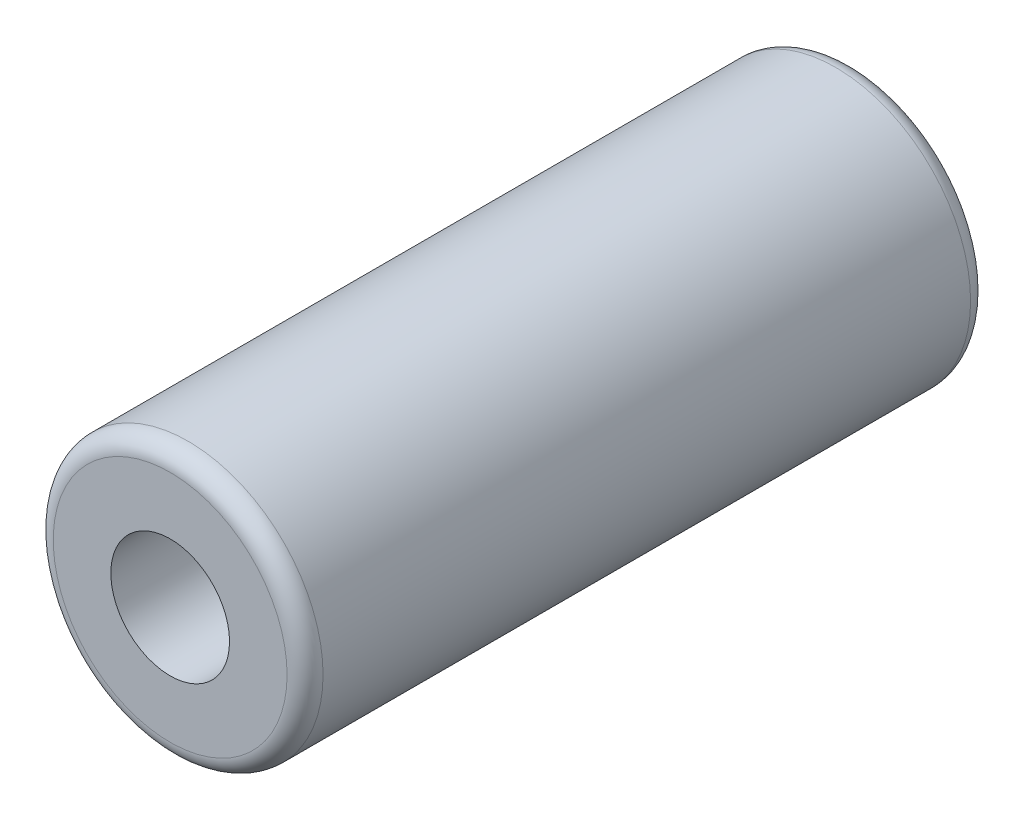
ISO-10303-21;
HEADER;
FILE_DESCRIPTION(('STEP AP214'),'2;1');
FILE_NAME('part.step','',(''),(''),'','','');
FILE_SCHEMA(('AUTOMOTIVE_DESIGN { 1 0 10303 214 1 1 1 1 }'));
ENDSEC;
DATA;
#1=APPLICATION_CONTEXT('core data for automotive mechanical design processes');
#2=APPLICATION_PROTOCOL_DEFINITION('international standard','automotive_design',2000,#1);
#3=PRODUCT_CONTEXT('',#1,'mechanical');
#4=PRODUCT('Part','Part','',(#3));
#5=PRODUCT_RELATED_PRODUCT_CATEGORY('part','',(#4));
#6=PRODUCT_DEFINITION_FORMATION('','',#4);
#7=PRODUCT_DEFINITION_CONTEXT('part definition',#1,'design');
#8=PRODUCT_DEFINITION('design','',#6,#7);
#9=PRODUCT_DEFINITION_SHAPE('','',#8);
#10=(LENGTH_UNIT() NAMED_UNIT(*) SI_UNIT(.MILLI.,.METRE.));
#11=(NAMED_UNIT(*) PLANE_ANGLE_UNIT() SI_UNIT($,.RADIAN.));
#12=(NAMED_UNIT(*) SI_UNIT($,.STERADIAN.) SOLID_ANGLE_UNIT());
#13=UNCERTAINTY_MEASURE_WITH_UNIT(LENGTH_MEASURE(1.E-05),#10,'distance_accuracy_value','');
#14=(GEOMETRIC_REPRESENTATION_CONTEXT(3) GLOBAL_UNCERTAINTY_ASSIGNED_CONTEXT((#13)) GLOBAL_UNIT_ASSIGNED_CONTEXT((#10,
#11,#12)) REPRESENTATION_CONTEXT('',''));
#15=CARTESIAN_POINT('',(0.,0.,0.));
#16=DIRECTION('',(0.,0.,1.));
#17=DIRECTION('',(1.,0.,0.));
#18=AXIS2_PLACEMENT_3D('',#15,#16,#17);
#19=CARTESIAN_POINT('',(0.,0.,190.));
#20=DIRECTION('',(0.,0.,-1.));
#21=DIRECTION('',(-1.,0.,0.));
#22=AXIS2_PLACEMENT_3D('',#19,#20,#21);
#23=CYLINDRICAL_SURFACE('',#22,37.5);
#24=CARTESIAN_POINT('',(0.,0.,5.));
#25=DIRECTION('',(0.,0.,1.));
#26=DIRECTION('',(1.,0.,0.));
#27=AXIS2_PLACEMENT_3D('',#24,#25,#26);
#28=CIRCLE('',#27,37.5);
#29=CARTESIAN_POINT('',(37.5,0.,5.));
#30=VERTEX_POINT('',#29);
#31=EDGE_CURVE('E41',#30,#30,#28,.T.);
#32=ORIENTED_EDGE('',*,*,#31,.T.);
#33=EDGE_LOOP('',(#32));
#34=FACE_BOUND('',#33,.T.);
#35=CARTESIAN_POINT('',(0.,0.,185.));
#36=DIRECTION('',(0.,0.,1.));
#37=DIRECTION('',(1.,0.,0.));
#38=AXIS2_PLACEMENT_3D('',#35,#36,#37);
#39=CIRCLE('',#38,37.5);
#40=CARTESIAN_POINT('',(37.5,0.,185.));
#41=VERTEX_POINT('',#40);
#42=EDGE_CURVE('E45',#41,#41,#39,.F.);
#43=ORIENTED_EDGE('',*,*,#42,.T.);
#44=EDGE_LOOP('',(#43));
#45=FACE_BOUND('',#44,.T.);
#46=ADVANCED_FACE('F30',(#34,#45),#23,.T.);
#47=CARTESIAN_POINT('',(0.,0.,190.));
#48=DIRECTION('',(0.,0.,1.));
#49=DIRECTION('',(1.,0.,0.));
#50=AXIS2_PLACEMENT_3D('',#47,#48,#49);
#51=PLANE('',#50);
#52=CARTESIAN_POINT('',(0.,0.,190.));
#53=DIRECTION('',(0.,0.,1.));
#54=DIRECTION('',(1.,0.,0.));
#55=AXIS2_PLACEMENT_3D('',#52,#53,#54);
#56=CIRCLE('',#55,32.5);
#57=CARTESIAN_POINT('',(32.5,0.,190.));
#58=VERTEX_POINT('',#57);
#59=EDGE_CURVE('E10',#58,#58,#56,.T.);
#60=ORIENTED_EDGE('',*,*,#59,.T.);
#61=EDGE_LOOP('',(#60));
#62=FACE_BOUND('',#61,.T.);
#63=CARTESIAN_POINT('',(0.,0.,190.));
#64=DIRECTION('',(0.,0.,1.));
#65=DIRECTION('',(1.,0.,0.));
#66=AXIS2_PLACEMENT_3D('',#63,#64,#65);
#67=CIRCLE('',#66,16.5);
#68=CARTESIAN_POINT('',(16.5,0.,190.));
#69=VERTEX_POINT('',#68);
#70=EDGE_CURVE('E53',#69,#69,#67,.T.);
#71=ORIENTED_EDGE('',*,*,#70,.F.);
#72=EDGE_LOOP('',(#71));
#73=FACE_BOUND('',#72,.T.);
#74=ADVANCED_FACE('F60',(#62,#73),#51,.T.);
#75=CARTESIAN_POINT('',(0.,0.,0.));
#76=DIRECTION('',(0.,0.,1.));
#77=DIRECTION('',(1.,0.,0.));
#78=AXIS2_PLACEMENT_3D('',#75,#76,#77);
#79=PLANE('',#78);
#80=CARTESIAN_POINT('',(0.,0.,0.));
#81=DIRECTION('',(0.,0.,1.));
#82=DIRECTION('',(1.,0.,0.));
#83=AXIS2_PLACEMENT_3D('',#80,#81,#82);
#84=CIRCLE('',#83,32.5);
#85=CARTESIAN_POINT('',(32.5,0.,0.));
#86=VERTEX_POINT('',#85);
#87=EDGE_CURVE('E37',#86,#86,#84,.F.);
#88=ORIENTED_EDGE('',*,*,#87,.T.);
#89=EDGE_LOOP('',(#88));
#90=FACE_BOUND('',#89,.T.);
#91=CARTESIAN_POINT('',(0.,0.,0.));
#92=DIRECTION('',(0.,0.,1.));
#93=DIRECTION('',(1.,0.,0.));
#94=AXIS2_PLACEMENT_3D('',#91,#92,#93);
#95=CIRCLE('',#94,16.5);
#96=CARTESIAN_POINT('',(16.5,0.,0.));
#97=VERTEX_POINT('',#96);
#98=EDGE_CURVE('E50',#97,#97,#95,.F.);
#99=ORIENTED_EDGE('',*,*,#98,.F.);
#100=EDGE_LOOP('',(#99));
#101=FACE_BOUND('',#100,.T.);
#102=ADVANCED_FACE('F62',(#90,#101),#79,.F.);
#103=CARTESIAN_POINT('',(0.,0.,-0.001000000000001));
#104=DIRECTION('',(0.,0.,1.));
#105=DIRECTION('',(1.,0.,0.));
#106=AXIS2_PLACEMENT_3D('',#103,#104,#105);
#107=CYLINDRICAL_SURFACE('',#106,16.5);
#108=CARTESIAN_POINT('',(16.5,0.,190.));
#109=CARTESIAN_POINT('',(16.5,0.,188.020833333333));
#110=CARTESIAN_POINT('',(16.5,0.,186.041666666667));
#111=CARTESIAN_POINT('',(16.5,0.,182.083333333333));
#112=CARTESIAN_POINT('',(16.5,0.,180.104166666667));
#113=CARTESIAN_POINT('',(16.5,0.,176.145833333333));
#114=CARTESIAN_POINT('',(16.5,0.,174.166666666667));
#115=CARTESIAN_POINT('',(16.5,0.,170.208333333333));
#116=CARTESIAN_POINT('',(16.5,0.,168.229166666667));
#117=CARTESIAN_POINT('',(16.5,0.,164.270833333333));
#118=CARTESIAN_POINT('',(16.5,0.,162.291666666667));
#119=CARTESIAN_POINT('',(16.5,0.,158.333333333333));
#120=CARTESIAN_POINT('',(16.5,0.,156.354166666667));
#121=CARTESIAN_POINT('',(16.5,0.,152.395833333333));
#122=CARTESIAN_POINT('',(16.5,0.,150.416666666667));
#123=CARTESIAN_POINT('',(16.5,0.,146.458333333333));
#124=CARTESIAN_POINT('',(16.5,0.,144.479166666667));
#125=CARTESIAN_POINT('',(16.5,0.,140.520833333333));
#126=CARTESIAN_POINT('',(16.5,0.,138.541666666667));
#127=CARTESIAN_POINT('',(16.5,0.,134.583333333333));
#128=CARTESIAN_POINT('',(16.5,0.,132.604166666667));
#129=CARTESIAN_POINT('',(16.5,0.,128.645833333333));
#130=CARTESIAN_POINT('',(16.5,0.,126.666666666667));
#131=CARTESIAN_POINT('',(16.5,0.,122.708333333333));
#132=CARTESIAN_POINT('',(16.5,0.,120.729166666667));
#133=CARTESIAN_POINT('',(16.5,0.,116.770833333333));
#134=CARTESIAN_POINT('',(16.5,0.,114.791666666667));
#135=CARTESIAN_POINT('',(16.5,0.,110.833333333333));
#136=CARTESIAN_POINT('',(16.5,0.,108.854166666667));
#137=CARTESIAN_POINT('',(16.5,0.,104.895833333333));
#138=CARTESIAN_POINT('',(16.5,0.,102.916666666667));
#139=CARTESIAN_POINT('',(16.5,0.,98.9583333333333));
#140=CARTESIAN_POINT('',(16.5,0.,96.9791666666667));
#141=CARTESIAN_POINT('',(16.5,0.,93.0208333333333));
#142=CARTESIAN_POINT('',(16.5,0.,91.0416666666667));
#143=CARTESIAN_POINT('',(16.5,0.,87.0833333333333));
#144=CARTESIAN_POINT('',(16.5,0.,85.1041666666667));
#145=CARTESIAN_POINT('',(16.5,0.,81.1458333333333));
#146=CARTESIAN_POINT('',(16.5,0.,79.1666666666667));
#147=CARTESIAN_POINT('',(16.5,0.,75.2083333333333));
#148=CARTESIAN_POINT('',(16.5,0.,73.2291666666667));
#149=CARTESIAN_POINT('',(16.5,0.,69.2708333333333));
#150=CARTESIAN_POINT('',(16.5,0.,67.2916666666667));
#151=CARTESIAN_POINT('',(16.5,0.,63.3333333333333));
#152=CARTESIAN_POINT('',(16.5,0.,61.3541666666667));
#153=CARTESIAN_POINT('',(16.5,0.,57.3958333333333));
#154=CARTESIAN_POINT('',(16.5,0.,55.4166666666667));
#155=CARTESIAN_POINT('',(16.5,0.,51.4583333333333));
#156=CARTESIAN_POINT('',(16.5,0.,49.4791666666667));
#157=CARTESIAN_POINT('',(16.5,0.,45.5208333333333));
#158=CARTESIAN_POINT('',(16.5,0.,43.5416666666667));
#159=CARTESIAN_POINT('',(16.5,0.,39.5833333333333));
#160=CARTESIAN_POINT('',(16.5,0.,37.6041666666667));
#161=CARTESIAN_POINT('',(16.5,0.,33.6458333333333));
#162=CARTESIAN_POINT('',(16.5,0.,31.6666666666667));
#163=CARTESIAN_POINT('',(16.5,0.,27.7083333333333));
#164=CARTESIAN_POINT('',(16.5,0.,25.7291666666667));
#165=CARTESIAN_POINT('',(16.5,0.,21.7708333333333));
#166=CARTESIAN_POINT('',(16.5,0.,19.7916666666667));
#167=CARTESIAN_POINT('',(16.5,0.,15.8333333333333));
#168=CARTESIAN_POINT('',(16.5,0.,13.8541666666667));
#169=CARTESIAN_POINT('',(16.5,0.,9.89583333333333));
#170=CARTESIAN_POINT('',(16.5,0.,7.91666666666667));
#171=CARTESIAN_POINT('',(16.5,0.,3.95833333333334));
#172=CARTESIAN_POINT('',(16.5,0.,1.97916666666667));
#173=CARTESIAN_POINT('',(16.5,0.,0.));
#174=B_SPLINE_CURVE_WITH_KNOTS('',3,(#108,#109,#110,#111,#112,#113,#114,#115,#116,#117,#118,
#119,#120,#121,#122,#123,#124,#125,#126,#127,#128,#129,#130,#131,#132,#133,#134,#135,#136,#137,
#138,#139,#140,#141,#142,#143,#144,#145,#146,#147,#148,#149,#150,#151,#152,#153,#154,#155,#156,
#157,#158,#159,#160,#161,#162,#163,#164,#165,#166,#167,#168,#169,#170,#171,#172,#173),
.UNSPECIFIED.,.F.,.F.,(4,2,2,2,2,2,2,2,2,2,2,2,2,2,2,2,2,2,2,2,2,2,2,2,2,2,2,2,2,2,2,2,4),(0.,
5.93750000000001,11.875,17.8125,23.75,29.6875,35.625,41.5625,47.5,53.4375,59.375,65.3125,71.25,
77.1875,83.125,89.0625,95.,100.9375,106.875,112.8125,118.75,124.6875,130.625,136.5625,142.5,
148.4375,154.375,160.3125,166.25,172.1875,178.125,184.0625,190.),.UNSPECIFIED.);
#175=EDGE_CURVE('BSEAM57',#69,#97,#174,.T.);
#176=ORIENTED_EDGE('',*,*,#70,.T.);
#177=ORIENTED_EDGE('',*,*,#98,.T.);
#178=ORIENTED_EDGE('',*,*,#175,.T.);
#179=ORIENTED_EDGE('',*,*,#175,.F.);
#180=EDGE_LOOP('',(#176,#178,#177,#179));
#181=FACE_BOUND('',#180,.T.);
#182=ADVANCED_FACE('F57',(#181),#107,.F.);
#183=CARTESIAN_POINT('',(0.,0.,5.));
#184=DIRECTION('',(0.,0.,1.));
#185=DIRECTION('',(1.,0.,0.));
#186=AXIS2_PLACEMENT_3D('',#183,#184,#185);
#187=TOROIDAL_SURFACE('',#186,32.5,5.);
#188=ORIENTED_EDGE('',*,*,#87,.F.);
#189=EDGE_LOOP('',(#188));
#190=FACE_BOUND('',#189,.T.);
#191=ORIENTED_EDGE('',*,*,#31,.F.);
#192=EDGE_LOOP('',(#191));
#193=FACE_BOUND('',#192,.T.);
#194=ADVANCED_FACE('F72',(#190,#193),#187,.T.);
#195=CARTESIAN_POINT('',(0.,0.,185.));
#196=DIRECTION('',(0.,0.,1.));
#197=DIRECTION('',(1.,0.,0.));
#198=AXIS2_PLACEMENT_3D('',#195,#196,#197);
#199=TOROIDAL_SURFACE('',#198,32.5,5.);
#200=ORIENTED_EDGE('',*,*,#42,.F.);
#201=EDGE_LOOP('',(#200));
#202=FACE_BOUND('',#201,.T.);
#203=ORIENTED_EDGE('',*,*,#59,.F.);
#204=EDGE_LOOP('',(#203));
#205=FACE_BOUND('',#204,.T.);
#206=ADVANCED_FACE('F32',(#202,#205),#199,.T.);
#207=CLOSED_SHELL('',(#46,#74,#102,#182,#194,#206));
#208=MANIFOLD_SOLID_BREP('B2',#207);
#209=ADVANCED_BREP_SHAPE_REPRESENTATION('',(#18,#208),#14);
#210=SHAPE_DEFINITION_REPRESENTATION(#9,#209);
ENDSEC;
END-ISO-10303-21;
